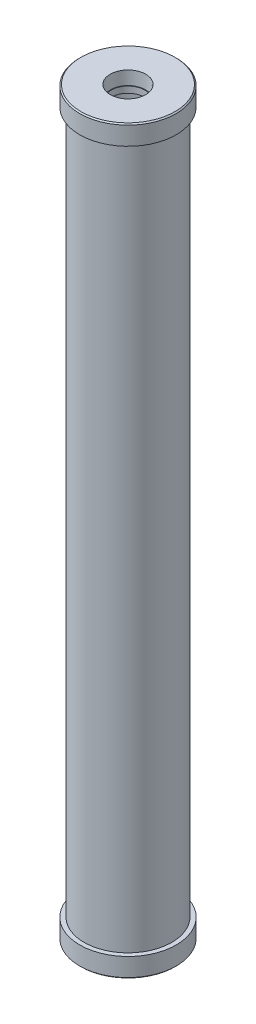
from build123d import *

# Parameters (mm, degrees)
SKETCH1_R           = 57.15
SKETCH1_R_2         = 50.546
BOSS_EXTRUDE1_DEPTH = 965.2
SKETCH2_R           = 62.865
BOSS_EXTRUDE2_DEPTH = 25.4
BOSS_EXTRUDE3_START = -25.4
SKETCH5_R           = 62.865
BOSS_EXTRUDE3_DEPTH = 25.4
CHAMFER1_SIZE       = 1.524


with BuildPart() as part:
    # Sketch1 → Boss-Extrude1 (new body)
    with BuildSketch(Plane(origin=(0, 0, 0), x_dir=(1, 0, 0), z_dir=(0, 1, 0))):
        with Locations(Location((0, 0, 0), (0, 0, 90))):
            Circle(SKETCH1_R)
        with Locations(Location((0, 0, 0), (0, 0, 90))):
            Circle(SKETCH1_R_2, mode=Mode.SUBTRACT)
    extrude(amount=BOSS_EXTRUDE1_DEPTH)

    # Sketch2 → Boss-Extrude2 (add)
    with BuildSketch(Plane(origin=(0, 0, 0), x_dir=(1, 0, 0), z_dir=(0, 1, 0))):
        with Locations(Location((0, 0, 0), (0, 0, 270))):
            Circle(SKETCH2_R)
    extrude(amount=BOSS_EXTRUDE2_DEPTH)

    # Sketch3 → 1-1_2 NPT Tapped Hole1 (revolve, cut)
    with BuildSketch(Plane(origin=(0, 0, 0), x_dir=(0, 0, -1), z_dir=(1, 0, 0))):
        Polygon((0, 0), (0, 41.565568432), (21.8313, 28.448), (21.8313, 17.272), (22.62588539, 17.272), (23.1430322, 0), align=None)
    revolve(axis=Axis((0, -6.35, 0), (0, 1, 0)), mode=Mode.SUBTRACT)

    # Sketch5 → Boss-Extrude3 (add)
    with BuildSketch(Plane(origin=(0, 965.2, 0), x_dir=(1, 0, 0), z_dir=(0, 1, 0)).offset(BOSS_EXTRUDE3_START)):
        with Locations(Location((0, 0, 0), (0, 0, 270))):
            Circle(SKETCH5_R)
    extrude(amount=BOSS_EXTRUDE3_DEPTH)

    # Sketch6 → 1-1_2 NPT Tapped Hole2 (revolve, cut)
    with BuildSketch(Plane(origin=(0, 965.2, 0), x_dir=(0, 0, 1), z_dir=(1, 0, 0))):
        Polygon((0, 0), (0, 41.565568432), (21.8313, 28.448), (21.8313, 17.272), (22.62588539, 17.272), (23.1430322, 0), align=None)
    revolve(axis=Axis((0, 971.55, 0), (0, -1, 0)), mode=Mode.SUBTRACT)

    # Chamfer1
    chamfer1_edges = [part.edges().sort_by_distance(p)[0] for p in [
        (0, 0, -62.865),
        (0, 965.2, -62.865),
    ]]
    chamfer(chamfer1_edges, length=CHAMFER1_SIZE)


solid = part.part
